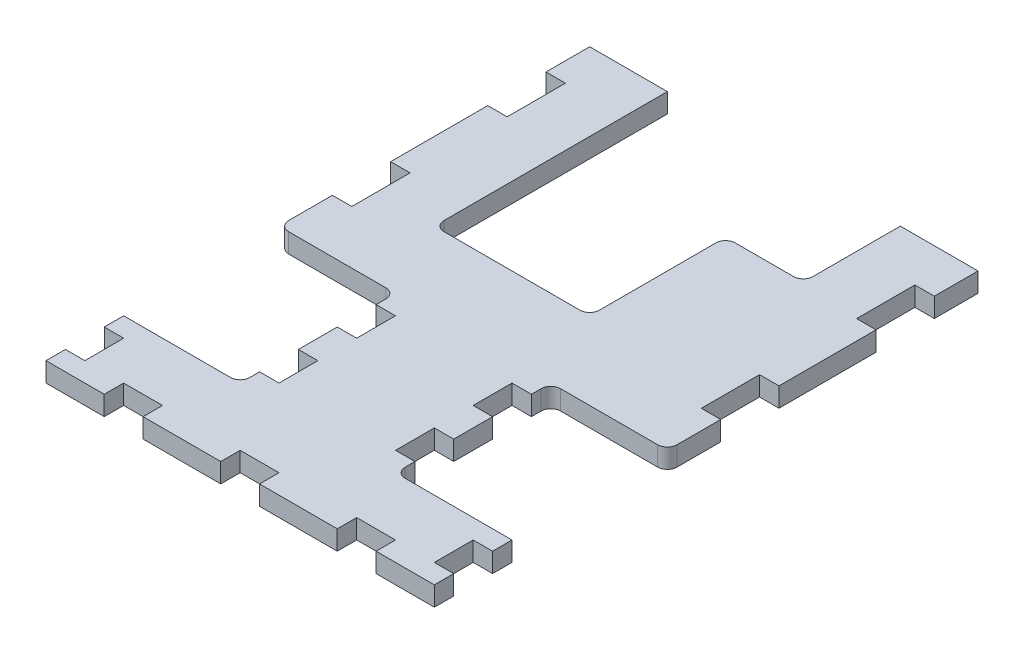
from build123d import *

# Parameters (mm, degrees)
BOSS_EXTRUDE1_DEPTH = 3.175
FILLET1_R           = 3.175
SKETCH2_W           = 6.35
SKETCH2_H           = 19.05
SKETCH2_H_2         = 12.7
SKETCH2_W_2         = 12.7
SKETCH2_H_3         = 6.35
CUT_EXTRUDE1_DEPTH  = 6.35


with BuildPart() as part:
    # Sketch1 → Boss-Extrude1 (new, symmetric)
    with BuildSketch(Plane(origin=(0, 0, 0), x_dir=(1, 0, 0), z_dir=(0, 1, 0))):
        Polygon((-38.1, 76.2), (-38.1, 0), (12.7, 0), (12.7, 44.45), (38.1, 44.45), (38.1, 76.2), (63.5, 76.2), (63.5, -25.4), (25.4, -25.4), (25.4, -76.2), (63.5, -76.2), (63.5, -101.6), (-63.5, -101.6), (-63.5, -76.2), (-25.4, -76.2), (-25.4, -25.4), (-63.5, -25.4), (-63.5, 76.2), align=None)
    extrude(amount=BOSS_EXTRUDE1_DEPTH, both=True)

    # Fillet1
    fillet1_edges = [part.edges().sort_by_distance(p)[0] for p in [
        (-38.1, 0, 0),
        (12.7, 0, 0),
        (12.7, 0, -44.45),
        (38.1, 0, -44.45),
        (63.5, 0, 25.4),
        (25.4, 0, 25.4),
        (25.4, 0, 76.2),
        (-25.4, 0, 76.2),
        (-25.4, 0, 25.4),
        (-63.5, 0, 25.4),
    ]]
    fillet(fillet1_edges, radius=FILLET1_R)

    # Sketch2 → Cut-Extrude1 (cut)
    with BuildSketch(Plane(origin=(0, 3.175, 0), x_dir=(1, 0, 0), z_dir=(0, 1, 0))):
        with Locations((-60.325, 52.3875)):
            Rectangle(SKETCH2_W, SKETCH2_H)
        with Locations((-60.325, 1.5875)):
            Rectangle(SKETCH2_W, SKETCH2_H)
        with Locations((-60.325, -88.9)):
            Rectangle(SKETCH2_W, SKETCH2_H_2)
        with Locations((-38.1, -98.425)):
            Rectangle(SKETCH2_W_2, SKETCH2_H_3)
        with Locations((60.325, -88.9)):
            Rectangle(SKETCH2_W, SKETCH2_H_2)
        with Locations((60.325, 1.5875)):
            Rectangle(SKETCH2_W, SKETCH2_H)
        with Locations((60.325, 52.3875)):
            Rectangle(SKETCH2_W, SKETCH2_H)
        with Locations((-22.225, -38.1)):
            Rectangle(SKETCH2_W, SKETCH2_H_2)
        with Locations((-22.225, -63.5)):
            Rectangle(SKETCH2_W, SKETCH2_H_2)
        with Locations((22.225, -63.5)):
            Rectangle(SKETCH2_W, SKETCH2_H_2)
        with Locations((22.225, -38.1)):
            Rectangle(SKETCH2_W, SKETCH2_H_2)
        with Locations((0, -98.425)):
            Rectangle(SKETCH2_W_2, SKETCH2_H_3)
        with Locations((38.1, -98.425)):
            Rectangle(SKETCH2_W_2, SKETCH2_H_3)
    extrude(amount=-CUT_EXTRUDE1_DEPTH, mode=Mode.SUBTRACT)


solid = part.part
